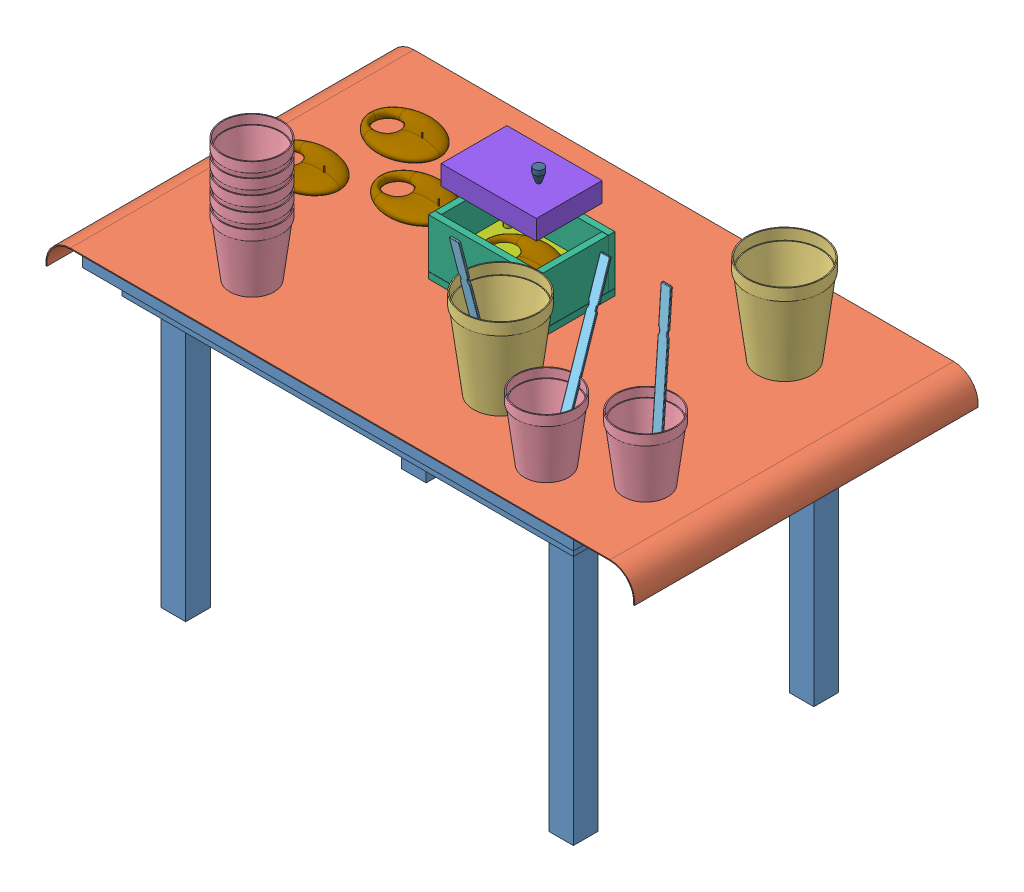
SolidWorks assembly TableSetup.SLDASM, configuration Default (file format 11000). Lengths in mm.
Overall size (1200 948.86 700).
27 component instances, 11 part files, 6 mates.
Components (placement in the parent):
- Table-1: Table.SLDPRT [Default] at origin size (1000 620 700)
- Paper-1: Paper.SLDPRT [Default] at (14.918 22 0) size (1200 56.19 700)
- Lcup-4: Lcup.SLDPRT [Default] at (899.4082 22 -530.9892) size (152.36 180 152.36)
- Lcup-5: Lcup.SLDPRT [Default] at (670.8742 22 -180.7439) size (152.36 180 152.36)
- Scup-4: Scup.SLDPRT [Default] at (214.921 22 -130.111) size (121.01 130 121.01)
- Scup-9: Scup.SLDPRT [Default] at (977.6326 22 -169.5206) size (121.01 130 121.01)
- Scup-10: Scup.SLDPRT [Default] at (842.4165 22 -102.6954) size (121.01 130 121.01)
- MixStick-4: MixStick.SLDPRT [Default] at (972.6477 29.363 -197.4283) x (1 0 0) z (0 -0.997564 0.069756) size (20 4 320)
- MixStick-6: MixStick.SLDPRT [Default] at (664.6743 26.5418 -175.746) x (1 0 0) z (0 -0.968148 -0.25038) size (20 4 320)
- MixStick-7: MixStick.SLDPRT [Default] at (843.1159 29.2661 -123.6904) x (1 0 0) z (0 -0.948324 0.317305) size (20 4 320)
- MixStick-8: MixStick.SLDPRT [Default] at (1415.2597 131.3497 367.9267) size (20 4 320) (hidden)
- MoldSetup-1: MoldSetup.SLDASM [Default] at (504.1559 22 -390.4104) size (220 231.34 160)
  - Sbox-1: Sbox.SLDPRT [Default] at origin size (220 113.5 160)
  - MoldA-1: MoldA.SLDPRT [Default] at (0 44.27 0) size (194 42 134)
  - MoldB-1: MoldB.SLDPRT [Default] at (0 163.6049 0) size (194 40 134)
  - Donut-1: Donut.SLDPRT [Default] at (0 44.27 0) size (144 27.59 110.24)
  - Funnel-1: Funnel.SLDPRT [Default] at (35.1735 196.3386 0.4833) size (20 55 20)
- Donut-1: Donut.SLDPRT [Default] at (87.9469 37.1138 -364.4476) size (144 27.59 110.24)
- Donut-2: Donut.SLDPRT [Default] at (254.674 37.5575 -422.6561) size (144 27.59 110.24)
- Donut-3: Donut.SLDPRT [Default] at (132.5681 37.4263 -523.8073) size (144 27.59 110.24)
- Sprue-1: Sprue.SLDPRT [Default] at (303.246 47.698 -422.439) size (2 13.85 2)
- Sprue-2: Sprue.SLDPRT [Default] at (128.0558 47.3439 -364.1947) size (2 13.85 2)
- Sprue-4: Sprue.SLDPRT [Default] at (167.9706 45.9363 -523.9921) size (2 13.85 2)
- Scup-5: Scup.SLDPRT [Default] at (214.921 52 -130.111) size (121.01 130 121.01)
- Scup-6: Scup.SLDPRT [Default] at (214.921 82 -130.111) size (121.01 130 121.01)
- Scup-7: Scup.SLDPRT [Default] at (214.921 112 -130.111) size (121.01 130 121.01)
- Scup-8: Scup.SLDPRT [Default] at (214.921 142 -130.111) size (121.01 130 121.01)
Mates (geometry in assembly coordinates):
- Coincident1: coincident: plane of Table-1 through (0 20 0) normal (0 1 0); plane of Paper-1 through (-25.082 20 0) normal (0 -1 0)
- Coincident2: coincident: plane of Table-1 through (0 20 -700) normal (0 0 -1); plane of Paper-1 through (1074.918 -28 -700) normal (0 0 -1)
- Coincident5: coincident: plane of Paper-1 through (-25.082 22 0) normal (0 1 0); plane of Scup-4 through (259.921 22 -130.111) normal (0 -1 0)
- Coincident6: coincident: plane of Paper-1 through (-25.082 22 0) normal (0 1 0); plane of Scup-10 through (887.4165 22 -102.6954) normal (0 -1 0)
- Coincident7: coincident: plane of Paper-1 through (-25.082 22 0) normal (0 1 0); plane of MoldSetup-1/Sbox-1 through (504.1559 22 -390.4104) normal (0 -1 0)
- Coincident8: coincident: plane of Paper-1 through (-25.082 22 0) normal (0 1 0); plane of Scup-9 through (1022.6326 22 -169.5206) normal (0 -1 0)
